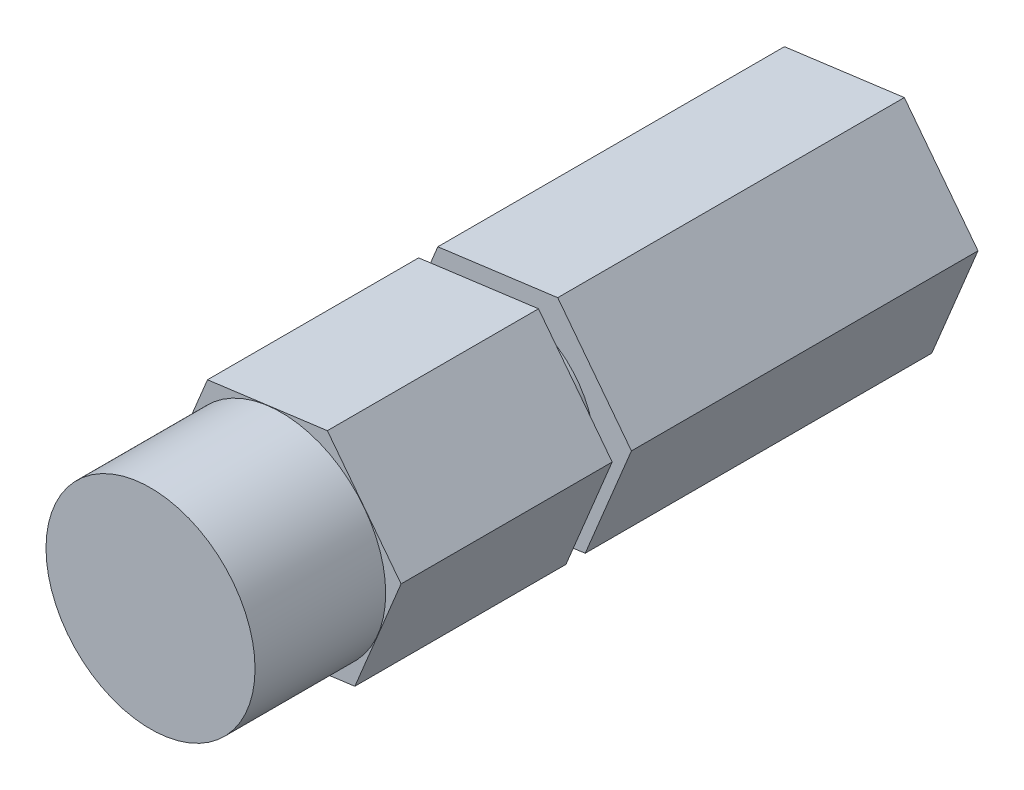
from build123d import *

# Parameters (mm, degrees)
BOSS_EXTRUDE1_DEPTH            = 35.052
TAP_DRILL_FOR_10_32_TAP1_D     = 4.0386
TAP_DRILL_FOR_10_32_TAP1_DEPTH = 12.7
TAP_DRILL_FOR_10_32_TAP1_TIP   = 1.213317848
SKETCH5_W                      = 4.355863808
SKETCH5_H                      = 1.1684


with BuildPart() as part:
    # Sketch1 → Revolve1 (revolve)
    with BuildSketch(Plane(origin=(0, 0, 0), x_dir=(0, 0, -1), z_dir=(1, 0, 0)), mode=Mode.PRIVATE) as revolve1_sk:
        Polygon((0, 0), (0, 6.35), (7.9375, 6.35), (7.9375, 6.3627), (42.9895, 6.3627), (42.9895, 0), align=None)
    revolve(revolve1_sk.sketch.rotate(Axis((0, 0, 0), (0, 0, -1)), 90), axis=Axis((0, 0, 0), (0, 0, -1)))

    # Sketch2 → Boss-Extrude1 (add)
    with BuildSketch(Plane.XY.offset(-7.9375)):
        Polygon((2.807143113, 6.789591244), (-4.476386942, 5.82585287), (-7.283530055, -0.963738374), (-2.807143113, -6.789591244), (4.476386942, -5.82585287), (7.283530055, 0.963738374), align=None)
    extrude(amount=-BOSS_EXTRUDE1_DEPTH)

    # Tap Drill for _10-32 Tap1
    with Locations(Plane(origin=(0, 0, -42.9895), x_dir=(-1, 0, 0), z_dir=(0, 0, -1))):
        with Locations((0, 0)):
            Hole(TAP_DRILL_FOR_10_32_TAP1_D / 2, depth=TAP_DRILL_FOR_10_32_TAP1_DEPTH)
            with Locations((0, 0, -(TAP_DRILL_FOR_10_32_TAP1_DEPTH + TAP_DRILL_FOR_10_32_TAP1_TIP / 2))):  # 118° drill point
                Cone(0, TAP_DRILL_FOR_10_32_TAP1_D / 2, TAP_DRILL_FOR_10_32_TAP1_TIP, mode=Mode.SUBTRACT)

    # Sketch5 → Cut-Revolve1 (revolve, cut)
    with BuildSketch(Plane(origin=(0, 0, 0), x_dir=(1, 0, 0), z_dir=(0, 1, 0)), mode=Mode.PRIVATE) as cut_revolve1_sk:
        with Locations((7.207131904, 21.3487)):
            Rectangle(SKETCH5_W, SKETCH5_H)
    revolve(cut_revolve1_sk.sketch.rotate(Axis((0, 0, 0), (0, 0, -1)), 180), axis=Axis((0, 0, 0), (0, 0, -1)), mode=Mode.SUBTRACT)


solid = part.part
